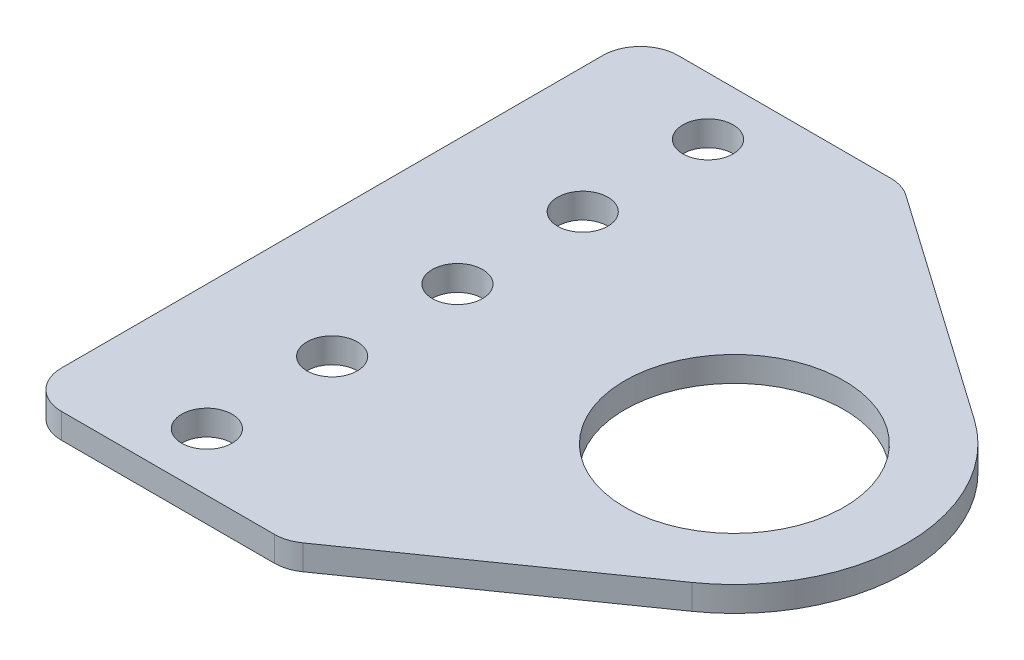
ISO-10303-21;
HEADER;
FILE_DESCRIPTION(('STEP AP214'),'2;1');
FILE_NAME('part.step','',(''),(''),'','','');
FILE_SCHEMA(('AUTOMOTIVE_DESIGN { 1 0 10303 214 1 1 1 1 }'));
ENDSEC;
DATA;
#1=APPLICATION_CONTEXT('core data for automotive mechanical design processes');
#2=APPLICATION_PROTOCOL_DEFINITION('international standard','automotive_design',2000,#1);
#3=PRODUCT_CONTEXT('',#1,'mechanical');
#4=PRODUCT('Part','Part','',(#3));
#5=PRODUCT_RELATED_PRODUCT_CATEGORY('part','',(#4));
#6=PRODUCT_DEFINITION_FORMATION('','',#4);
#7=PRODUCT_DEFINITION_CONTEXT('part definition',#1,'design');
#8=PRODUCT_DEFINITION('design','',#6,#7);
#9=PRODUCT_DEFINITION_SHAPE('','',#8);
#10=(LENGTH_UNIT() NAMED_UNIT(*) SI_UNIT(.MILLI.,.METRE.));
#11=(NAMED_UNIT(*) PLANE_ANGLE_UNIT() SI_UNIT($,.RADIAN.));
#12=(NAMED_UNIT(*) SI_UNIT($,.STERADIAN.) SOLID_ANGLE_UNIT());
#13=UNCERTAINTY_MEASURE_WITH_UNIT(LENGTH_MEASURE(1.E-05),#10,'distance_accuracy_value','');
#14=(GEOMETRIC_REPRESENTATION_CONTEXT(3) GLOBAL_UNCERTAINTY_ASSIGNED_CONTEXT((#13)) GLOBAL_UNIT_ASSIGNED_CONTEXT((#10,
#11,#12)) REPRESENTATION_CONTEXT('',''));
#15=CARTESIAN_POINT('',(0.,0.,0.));
#16=DIRECTION('',(0.,0.,1.));
#17=DIRECTION('',(1.,0.,0.));
#18=AXIS2_PLACEMENT_3D('',#15,#16,#17);
#19=CARTESIAN_POINT('',(-15.375,2.54,27.44));
#20=DIRECTION('',(0.,1.,0.));
#21=DIRECTION('',(0.,0.,1.));
#22=AXIS2_PLACEMENT_3D('',#19,#20,#21);
#23=PLANE('',#22);
#24=CARTESIAN_POINT('',(-28.075,2.54,12.7));
#25=DIRECTION('',(0.,1.,0.));
#26=DIRECTION('',(0.,0.,1.));
#27=AXIS2_PLACEMENT_3D('',#24,#25,#26);
#28=CIRCLE('',#27,2.5527);
#29=CARTESIAN_POINT('',(-28.075,2.54,15.2527));
#30=VERTEX_POINT('',#29);
#31=EDGE_CURVE('E286',#30,#30,#28,.T.);
#32=ORIENTED_EDGE('',*,*,#31,.F.);
#33=EDGE_LOOP('',(#32));
#34=FACE_BOUND('',#33,.T.);
#35=CARTESIAN_POINT('',(-28.075,2.54,-12.7));
#36=DIRECTION('',(0.,1.,0.));
#37=DIRECTION('',(0.,0.,1.));
#38=AXIS2_PLACEMENT_3D('',#35,#36,#37);
#39=CIRCLE('',#38,2.5527);
#40=CARTESIAN_POINT('',(-28.075,2.54,-10.1473));
#41=VERTEX_POINT('',#40);
#42=EDGE_CURVE('E270',#41,#41,#39,.T.);
#43=ORIENTED_EDGE('',*,*,#42,.F.);
#44=EDGE_LOOP('',(#43));
#45=FACE_BOUND('',#44,.T.);
#46=CARTESIAN_POINT('',(0.,2.54,0.));
#47=DIRECTION('',(0.,1.,0.));
#48=DIRECTION('',(0.,0.,1.));
#49=AXIS2_PLACEMENT_3D('',#46,#47,#48);
#50=CIRCLE('',#49,11.1125);
#51=CARTESIAN_POINT('',(0.,2.54,11.1125));
#52=VERTEX_POINT('',#51);
#53=EDGE_CURVE('E166',#52,#52,#50,.T.);
#54=ORIENTED_EDGE('',*,*,#53,.F.);
#55=EDGE_LOOP('',(#54));
#56=FACE_BOUND('',#55,.T.);
#57=CARTESIAN_POINT('',(-15.375,2.54,27.44));
#58=DIRECTION('',(0.,1.,0.));
#59=DIRECTION('',(0.,0.,1.));
#60=AXIS2_PLACEMENT_3D('',#57,#58,#59);
#61=CIRCLE('',#60,3.81);
#62=CARTESIAN_POINT('',(-15.375,2.54,31.25));
#63=VERTEX_POINT('',#62);
#64=CARTESIAN_POINT('',(-13.1889805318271,2.54,30.5604837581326));
#65=VERTEX_POINT('',#64);
#66=EDGE_CURVE('E190',#63,#65,#61,.T.);
#67=ORIENTED_EDGE('',*,*,#66,.T.);
#68=DIRECTION('',(0.819024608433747,0.,-0.573758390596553));
#69=VECTOR('',#68,1.);
#70=CARTESIAN_POINT('',(-13.1889805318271,2.54,30.5604837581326));
#71=LINE('',#70,#69);
#72=CARTESIAN_POINT('',(10.0192558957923,2.54,14.3022172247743));
#73=VERTEX_POINT('',#72);
#74=EDGE_CURVE('E113',#65,#73,#71,.T.);
#75=ORIENTED_EDGE('',*,*,#74,.T.);
#76=CARTESIAN_POINT('',(0.,2.54,0.));
#77=DIRECTION('',(0.,1.,0.));
#78=DIRECTION('',(0.,0.,1.));
#79=AXIS2_PLACEMENT_3D('',#76,#77,#78);
#80=CIRCLE('',#79,17.4625);
#81=CARTESIAN_POINT('',(10.0192558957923,2.54,-14.3022172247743));
#82=VERTEX_POINT('',#81);
#83=EDGE_CURVE('E220',#73,#82,#80,.T.);
#84=ORIENTED_EDGE('',*,*,#83,.T.);
#85=DIRECTION('',(-0.819024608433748,0.,-0.573758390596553));
#86=VECTOR('',#85,1.);
#87=CARTESIAN_POINT('',(10.0192558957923,2.54,-14.3022172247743));
#88=LINE('',#87,#86);
#89=CARTESIAN_POINT('',(-13.1889805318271,2.54,-30.5604837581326));
#90=VERTEX_POINT('',#89);
#91=EDGE_CURVE('E240',#82,#90,#88,.T.);
#92=ORIENTED_EDGE('',*,*,#91,.T.);
#93=CARTESIAN_POINT('',(-15.375,2.54,-27.44));
#94=DIRECTION('',(0.,1.,0.));
#95=DIRECTION('',(0.,0.,-1.));
#96=AXIS2_PLACEMENT_3D('',#93,#94,#95);
#97=CIRCLE('',#96,3.81);
#98=CARTESIAN_POINT('',(-15.375,2.54,-31.25));
#99=VERTEX_POINT('',#98);
#100=EDGE_CURVE('E236',#90,#99,#97,.T.);
#101=ORIENTED_EDGE('',*,*,#100,.T.);
#102=DIRECTION('',(-1.,0.,0.));
#103=VECTOR('',#102,1.);
#104=CARTESIAN_POINT('',(-36.965,2.54,-31.25));
#105=LINE('',#104,#103);
#106=CARTESIAN_POINT('',(-36.965,2.54,-31.25));
#107=VERTEX_POINT('',#106);
#108=EDGE_CURVE('E239',#99,#107,#105,.T.);
#109=ORIENTED_EDGE('',*,*,#108,.T.);
#110=CARTESIAN_POINT('',(-36.965,2.54,-27.44));
#111=DIRECTION('',(0.,1.,0.));
#112=DIRECTION('',(0.,0.,1.));
#113=AXIS2_PLACEMENT_3D('',#110,#111,#112);
#114=CIRCLE('',#113,3.81);
#115=CARTESIAN_POINT('',(-40.775,2.54,-27.44));
#116=VERTEX_POINT('',#115);
#117=EDGE_CURVE('E138',#107,#116,#114,.T.);
#118=ORIENTED_EDGE('',*,*,#117,.T.);
#119=DIRECTION('',(0.,0.,1.));
#120=VECTOR('',#119,1.);
#121=CARTESIAN_POINT('',(-40.775,2.54,27.44));
#122=LINE('',#121,#120);
#123=CARTESIAN_POINT('',(-40.775,2.54,27.44));
#124=VERTEX_POINT('',#123);
#125=EDGE_CURVE('E132',#116,#124,#122,.T.);
#126=ORIENTED_EDGE('',*,*,#125,.T.);
#127=CARTESIAN_POINT('',(-36.965,2.54,27.44));
#128=DIRECTION('',(0.,1.,0.));
#129=DIRECTION('',(0.,0.,1.));
#130=AXIS2_PLACEMENT_3D('',#127,#128,#129);
#131=CIRCLE('',#130,3.81);
#132=CARTESIAN_POINT('',(-36.965,2.54,31.25));
#133=VERTEX_POINT('',#132);
#134=EDGE_CURVE('E136',#124,#133,#131,.T.);
#135=ORIENTED_EDGE('',*,*,#134,.T.);
#136=DIRECTION('',(1.,0.,0.));
#137=VECTOR('',#136,1.);
#138=CARTESIAN_POINT('',(-15.375,2.54,31.25));
#139=LINE('',#138,#137);
#140=EDGE_CURVE('E64',#133,#63,#139,.T.);
#141=ORIENTED_EDGE('',*,*,#140,.T.);
#142=EDGE_LOOP('',(#67,#75,#84,#92,#101,#109,#118,#126,#135,#141));
#143=FACE_BOUND('',#142,.T.);
#144=CARTESIAN_POINT('',(-28.075,2.54,-25.4));
#145=DIRECTION('',(0.,1.,0.));
#146=DIRECTION('',(0.,0.,1.));
#147=AXIS2_PLACEMENT_3D('',#144,#145,#146);
#148=CIRCLE('',#147,2.5527);
#149=CARTESIAN_POINT('',(-28.075,2.54,-22.8473));
#150=VERTEX_POINT('',#149);
#151=EDGE_CURVE('E262',#150,#150,#148,.T.);
#152=ORIENTED_EDGE('',*,*,#151,.F.);
#153=EDGE_LOOP('',(#152));
#154=FACE_BOUND('',#153,.T.);
#155=CARTESIAN_POINT('',(-28.075,2.54,0.));
#156=DIRECTION('',(0.,1.,0.));
#157=DIRECTION('',(0.,0.,1.));
#158=AXIS2_PLACEMENT_3D('',#155,#156,#157);
#159=CIRCLE('',#158,2.55269999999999);
#160=CARTESIAN_POINT('',(-28.075,2.54,2.55269999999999));
#161=VERTEX_POINT('',#160);
#162=EDGE_CURVE('E278',#161,#161,#159,.T.);
#163=ORIENTED_EDGE('',*,*,#162,.F.);
#164=EDGE_LOOP('',(#163));
#165=FACE_BOUND('',#164,.T.);
#166=CARTESIAN_POINT('',(-28.075,2.54,25.4));
#167=DIRECTION('',(0.,1.,0.));
#168=DIRECTION('',(0.,0.,1.));
#169=AXIS2_PLACEMENT_3D('',#166,#167,#168);
#170=CIRCLE('',#169,2.5527);
#171=CARTESIAN_POINT('',(-28.075,2.54,27.9527));
#172=VERTEX_POINT('',#171);
#173=EDGE_CURVE('E294',#172,#172,#170,.T.);
#174=ORIENTED_EDGE('',*,*,#173,.F.);
#175=EDGE_LOOP('',(#174));
#176=FACE_BOUND('',#175,.T.);
#177=ADVANCED_FACE('F46',(#34,#45,#56,#143,#154,#165,#176),#23,.T.);
#178=CARTESIAN_POINT('',(-15.375,0.,27.44));
#179=DIRECTION('',(0.,1.,0.));
#180=DIRECTION('',(0.,0.,1.));
#181=AXIS2_PLACEMENT_3D('',#178,#179,#180);
#182=PLANE('',#181);
#183=CARTESIAN_POINT('',(-15.375,0.,27.44));
#184=DIRECTION('',(0.,1.,0.));
#185=DIRECTION('',(0.,0.,1.));
#186=AXIS2_PLACEMENT_3D('',#183,#184,#185);
#187=CIRCLE('',#186,3.81);
#188=CARTESIAN_POINT('',(-15.375,0.,31.25));
#189=VERTEX_POINT('',#188);
#190=CARTESIAN_POINT('',(-13.1889805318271,0.,30.5604837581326));
#191=VERTEX_POINT('',#190);
#192=EDGE_CURVE('E161',#189,#191,#187,.T.);
#193=ORIENTED_EDGE('',*,*,#192,.F.);
#194=DIRECTION('',(1.,0.,0.));
#195=VECTOR('',#194,1.);
#196=CARTESIAN_POINT('',(-15.375,0.,31.25));
#197=LINE('',#196,#195);
#198=CARTESIAN_POINT('',(-36.965,0.,31.25));
#199=VERTEX_POINT('',#198);
#200=EDGE_CURVE('E105',#199,#189,#197,.T.);
#201=ORIENTED_EDGE('',*,*,#200,.F.);
#202=CARTESIAN_POINT('',(-36.965,0.,27.44));
#203=DIRECTION('',(0.,1.,0.));
#204=DIRECTION('',(0.,0.,1.));
#205=AXIS2_PLACEMENT_3D('',#202,#203,#204);
#206=CIRCLE('',#205,3.81);
#207=CARTESIAN_POINT('',(-40.775,0.,27.44));
#208=VERTEX_POINT('',#207);
#209=EDGE_CURVE('E99',#208,#199,#206,.T.);
#210=ORIENTED_EDGE('',*,*,#209,.F.);
#211=DIRECTION('',(0.,0.,1.));
#212=VECTOR('',#211,1.);
#213=CARTESIAN_POINT('',(-40.775,0.,27.44));
#214=LINE('',#213,#212);
#215=CARTESIAN_POINT('',(-40.775,0.,-27.44));
#216=VERTEX_POINT('',#215);
#217=EDGE_CURVE('E147',#216,#208,#214,.T.);
#218=ORIENTED_EDGE('',*,*,#217,.F.);
#219=CARTESIAN_POINT('',(-36.965,0.,-27.44));
#220=DIRECTION('',(0.,1.,0.));
#221=DIRECTION('',(0.,0.,1.));
#222=AXIS2_PLACEMENT_3D('',#219,#220,#221);
#223=CIRCLE('',#222,3.81);
#224=CARTESIAN_POINT('',(-36.965,0.,-31.25));
#225=VERTEX_POINT('',#224);
#226=EDGE_CURVE('E181',#225,#216,#223,.T.);
#227=ORIENTED_EDGE('',*,*,#226,.F.);
#228=DIRECTION('',(-1.,0.,0.));
#229=VECTOR('',#228,1.);
#230=CARTESIAN_POINT('',(-36.965,0.,-31.25));
#231=LINE('',#230,#229);
#232=CARTESIAN_POINT('',(-15.375,0.,-31.25));
#233=VERTEX_POINT('',#232);
#234=EDGE_CURVE('E178',#233,#225,#231,.T.);
#235=ORIENTED_EDGE('',*,*,#234,.F.);
#236=CARTESIAN_POINT('',(-15.375,0.,-27.44));
#237=DIRECTION('',(0.,1.,0.));
#238=DIRECTION('',(0.,0.,-1.));
#239=AXIS2_PLACEMENT_3D('',#236,#237,#238);
#240=CIRCLE('',#239,3.81);
#241=CARTESIAN_POINT('',(-13.1889805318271,0.,-30.5604837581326));
#242=VERTEX_POINT('',#241);
#243=EDGE_CURVE('E175',#242,#233,#240,.T.);
#244=ORIENTED_EDGE('',*,*,#243,.F.);
#245=DIRECTION('',(-0.819024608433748,0.,-0.573758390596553));
#246=VECTOR('',#245,1.);
#247=CARTESIAN_POINT('',(10.0192558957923,0.,-14.3022172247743));
#248=LINE('',#247,#246);
#249=CARTESIAN_POINT('',(10.0192558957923,0.,-14.3022172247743));
#250=VERTEX_POINT('',#249);
#251=EDGE_CURVE('E172',#250,#242,#248,.T.);
#252=ORIENTED_EDGE('',*,*,#251,.F.);
#253=CARTESIAN_POINT('',(0.,0.,0.));
#254=DIRECTION('',(0.,1.,0.));
#255=DIRECTION('',(0.,0.,1.));
#256=AXIS2_PLACEMENT_3D('',#253,#254,#255);
#257=CIRCLE('',#256,17.4625);
#258=CARTESIAN_POINT('',(10.0192558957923,0.,14.3022172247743));
#259=VERTEX_POINT('',#258);
#260=EDGE_CURVE('E169',#259,#250,#257,.T.);
#261=ORIENTED_EDGE('',*,*,#260,.F.);
#262=DIRECTION('',(0.819024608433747,0.,-0.573758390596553));
#263=VECTOR('',#262,1.);
#264=CARTESIAN_POINT('',(-13.1889805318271,0.,30.5604837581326));
#265=LINE('',#264,#263);
#266=EDGE_CURVE('E165',#191,#259,#265,.T.);
#267=ORIENTED_EDGE('',*,*,#266,.F.);
#268=EDGE_LOOP('',(#193,#201,#210,#218,#227,#235,#244,#252,#261,#267));
#269=FACE_BOUND('',#268,.T.);
#270=CARTESIAN_POINT('',(0.,0.,0.));
#271=DIRECTION('',(0.,1.,0.));
#272=DIRECTION('',(0.,0.,1.));
#273=AXIS2_PLACEMENT_3D('',#270,#271,#272);
#274=CIRCLE('',#273,11.1125);
#275=CARTESIAN_POINT('',(0.,0.,11.1125));
#276=VERTEX_POINT('',#275);
#277=EDGE_CURVE('E258',#276,#276,#274,.T.);
#278=ORIENTED_EDGE('',*,*,#277,.T.);
#279=EDGE_LOOP('',(#278));
#280=FACE_BOUND('',#279,.T.);
#281=CARTESIAN_POINT('',(-28.075,0.,-25.4));
#282=DIRECTION('',(0.,1.,0.));
#283=DIRECTION('',(0.,0.,1.));
#284=AXIS2_PLACEMENT_3D('',#281,#282,#283);
#285=CIRCLE('',#284,2.5527);
#286=CARTESIAN_POINT('',(-28.075,0.,-22.8473));
#287=VERTEX_POINT('',#286);
#288=EDGE_CURVE('E266',#287,#287,#285,.T.);
#289=ORIENTED_EDGE('',*,*,#288,.T.);
#290=EDGE_LOOP('',(#289));
#291=FACE_BOUND('',#290,.T.);
#292=CARTESIAN_POINT('',(-28.075,0.,-12.7));
#293=DIRECTION('',(0.,1.,0.));
#294=DIRECTION('',(0.,0.,1.));
#295=AXIS2_PLACEMENT_3D('',#292,#293,#294);
#296=CIRCLE('',#295,2.5527);
#297=CARTESIAN_POINT('',(-28.075,0.,-10.1473));
#298=VERTEX_POINT('',#297);
#299=EDGE_CURVE('E274',#298,#298,#296,.T.);
#300=ORIENTED_EDGE('',*,*,#299,.T.);
#301=EDGE_LOOP('',(#300));
#302=FACE_BOUND('',#301,.T.);
#303=CARTESIAN_POINT('',(-28.075,0.,0.));
#304=DIRECTION('',(0.,1.,0.));
#305=DIRECTION('',(0.,0.,1.));
#306=AXIS2_PLACEMENT_3D('',#303,#304,#305);
#307=CIRCLE('',#306,2.55269999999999);
#308=CARTESIAN_POINT('',(-28.075,0.,2.55269999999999));
#309=VERTEX_POINT('',#308);
#310=EDGE_CURVE('E282',#309,#309,#307,.T.);
#311=ORIENTED_EDGE('',*,*,#310,.T.);
#312=EDGE_LOOP('',(#311));
#313=FACE_BOUND('',#312,.T.);
#314=CARTESIAN_POINT('',(-28.075,0.,12.7));
#315=DIRECTION('',(0.,1.,0.));
#316=DIRECTION('',(0.,0.,1.));
#317=AXIS2_PLACEMENT_3D('',#314,#315,#316);
#318=CIRCLE('',#317,2.5527);
#319=CARTESIAN_POINT('',(-28.075,0.,15.2527));
#320=VERTEX_POINT('',#319);
#321=EDGE_CURVE('E290',#320,#320,#318,.T.);
#322=ORIENTED_EDGE('',*,*,#321,.T.);
#323=EDGE_LOOP('',(#322));
#324=FACE_BOUND('',#323,.T.);
#325=CARTESIAN_POINT('',(-28.075,0.,25.4));
#326=DIRECTION('',(0.,1.,0.));
#327=DIRECTION('',(0.,0.,1.));
#328=AXIS2_PLACEMENT_3D('',#325,#326,#327);
#329=CIRCLE('',#328,2.5527);
#330=CARTESIAN_POINT('',(-28.075,0.,27.9527));
#331=VERTEX_POINT('',#330);
#332=EDGE_CURVE('E298',#331,#331,#329,.T.);
#333=ORIENTED_EDGE('',*,*,#332,.T.);
#334=EDGE_LOOP('',(#333));
#335=FACE_BOUND('',#334,.T.);
#336=ADVANCED_FACE('F224',(#269,#280,#291,#302,#313,#324,#335),#182,.F.);
#337=CARTESIAN_POINT('',(-15.375,2.54,27.44));
#338=DIRECTION('',(0.,-1.,0.));
#339=DIRECTION('',(0.,0.,-1.));
#340=AXIS2_PLACEMENT_3D('',#337,#338,#339);
#341=CYLINDRICAL_SURFACE('',#340,3.81);
#342=ORIENTED_EDGE('',*,*,#192,.T.);
#343=DIRECTION('',(0.,-1.,0.));
#344=VECTOR('',#343,1.);
#345=CARTESIAN_POINT('',(-13.1889805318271,2.54,30.5604837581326));
#346=LINE('',#345,#344);
#347=EDGE_CURVE('E13',#65,#191,#346,.T.);
#348=ORIENTED_EDGE('',*,*,#347,.F.);
#349=ORIENTED_EDGE('',*,*,#66,.F.);
#350=DIRECTION('',(0.,-1.,0.));
#351=VECTOR('',#350,1.);
#352=CARTESIAN_POINT('',(-15.375,2.54,31.25));
#353=LINE('',#352,#351);
#354=EDGE_CURVE('E157',#63,#189,#353,.T.);
#355=ORIENTED_EDGE('',*,*,#354,.T.);
#356=EDGE_LOOP('',(#342,#348,#349,#355));
#357=FACE_BOUND('',#356,.T.);
#358=ADVANCED_FACE('F48',(#357),#341,.T.);
#359=CARTESIAN_POINT('',(-13.1889805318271,2.54,30.5604837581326));
#360=DIRECTION('',(-0.573758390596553,0.,-0.819024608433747));
#361=DIRECTION('',(-0.819024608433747,0.,0.573758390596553));
#362=AXIS2_PLACEMENT_3D('',#359,#360,#361);
#363=PLANE('',#362);
#364=ORIENTED_EDGE('',*,*,#266,.T.);
#365=DIRECTION('',(0.,-1.,0.));
#366=VECTOR('',#365,1.);
#367=CARTESIAN_POINT('',(10.0192558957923,2.54,14.3022172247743));
#368=LINE('',#367,#366);
#369=EDGE_CURVE('E56',#73,#259,#368,.T.);
#370=ORIENTED_EDGE('',*,*,#369,.F.);
#371=ORIENTED_EDGE('',*,*,#74,.F.);
#372=ORIENTED_EDGE('',*,*,#347,.T.);
#373=EDGE_LOOP('',(#364,#370,#371,#372));
#374=FACE_BOUND('',#373,.T.);
#375=ADVANCED_FACE('F343',(#374),#363,.F.);
#376=CARTESIAN_POINT('',(0.,2.54,0.));
#377=DIRECTION('',(0.,-1.,0.));
#378=DIRECTION('',(0.,0.,-1.));
#379=AXIS2_PLACEMENT_3D('',#376,#377,#378);
#380=CYLINDRICAL_SURFACE('',#379,17.4625);
#381=ORIENTED_EDGE('',*,*,#260,.T.);
#382=DIRECTION('',(0.,-1.,0.));
#383=VECTOR('',#382,1.);
#384=CARTESIAN_POINT('',(10.0192558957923,2.54,-14.3022172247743));
#385=LINE('',#384,#383);
#386=EDGE_CURVE('E209',#82,#250,#385,.T.);
#387=ORIENTED_EDGE('',*,*,#386,.F.);
#388=ORIENTED_EDGE('',*,*,#83,.F.);
#389=ORIENTED_EDGE('',*,*,#369,.T.);
#390=EDGE_LOOP('',(#381,#387,#388,#389));
#391=FACE_BOUND('',#390,.T.);
#392=ADVANCED_FACE('F218',(#391),#380,.T.);
#393=CARTESIAN_POINT('',(10.0192558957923,2.54,-14.3022172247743));
#394=DIRECTION('',(-0.573758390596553,0.,0.819024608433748));
#395=DIRECTION('',(0.819024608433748,0.,0.573758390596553));
#396=AXIS2_PLACEMENT_3D('',#393,#394,#395);
#397=PLANE('',#396);
#398=ORIENTED_EDGE('',*,*,#251,.T.);
#399=DIRECTION('',(0.,-1.,0.));
#400=VECTOR('',#399,1.);
#401=CARTESIAN_POINT('',(-13.1889805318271,2.54,-30.5604837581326));
#402=LINE('',#401,#400);
#403=EDGE_CURVE('E205',#90,#242,#402,.T.);
#404=ORIENTED_EDGE('',*,*,#403,.F.);
#405=ORIENTED_EDGE('',*,*,#91,.F.);
#406=ORIENTED_EDGE('',*,*,#386,.T.);
#407=EDGE_LOOP('',(#398,#404,#405,#406));
#408=FACE_BOUND('',#407,.T.);
#409=ADVANCED_FACE('F230',(#408),#397,.F.);
#410=CARTESIAN_POINT('',(-15.375,2.54,-27.44));
#411=DIRECTION('',(0.,-1.,0.));
#412=DIRECTION('',(0.,0.,-1.));
#413=AXIS2_PLACEMENT_3D('',#410,#411,#412);
#414=CYLINDRICAL_SURFACE('',#413,3.81);
#415=ORIENTED_EDGE('',*,*,#243,.T.);
#416=DIRECTION('',(0.,-1.,0.));
#417=VECTOR('',#416,1.);
#418=CARTESIAN_POINT('',(-15.375,2.54,-31.25));
#419=LINE('',#418,#417);
#420=EDGE_CURVE('E201',#99,#233,#419,.T.);
#421=ORIENTED_EDGE('',*,*,#420,.F.);
#422=ORIENTED_EDGE('',*,*,#100,.F.);
#423=ORIENTED_EDGE('',*,*,#403,.T.);
#424=EDGE_LOOP('',(#415,#421,#422,#423));
#425=FACE_BOUND('',#424,.T.);
#426=ADVANCED_FACE('F234',(#425),#414,.T.);
#427=CARTESIAN_POINT('',(-36.965,2.54,-31.25));
#428=DIRECTION('',(0.,0.,1.));
#429=DIRECTION('',(1.,0.,0.));
#430=AXIS2_PLACEMENT_3D('',#427,#428,#429);
#431=PLANE('',#430);
#432=ORIENTED_EDGE('',*,*,#234,.T.);
#433=DIRECTION('',(0.,-1.,0.));
#434=VECTOR('',#433,1.);
#435=CARTESIAN_POINT('',(-36.965,2.54,-31.25));
#436=LINE('',#435,#434);
#437=EDGE_CURVE('E197',#107,#225,#436,.T.);
#438=ORIENTED_EDGE('',*,*,#437,.F.);
#439=ORIENTED_EDGE('',*,*,#108,.F.);
#440=ORIENTED_EDGE('',*,*,#420,.T.);
#441=EDGE_LOOP('',(#432,#438,#439,#440));
#442=FACE_BOUND('',#441,.T.);
#443=ADVANCED_FACE('F333',(#442),#431,.F.);
#444=CARTESIAN_POINT('',(-36.965,2.54,-27.44));
#445=DIRECTION('',(0.,-1.,0.));
#446=DIRECTION('',(0.,0.,-1.));
#447=AXIS2_PLACEMENT_3D('',#444,#445,#446);
#448=CYLINDRICAL_SURFACE('',#447,3.81);
#449=ORIENTED_EDGE('',*,*,#226,.T.);
#450=DIRECTION('',(0.,-1.,0.));
#451=VECTOR('',#450,1.);
#452=CARTESIAN_POINT('',(-40.775,2.54,-27.44));
#453=LINE('',#452,#451);
#454=EDGE_CURVE('E149',#116,#216,#453,.T.);
#455=ORIENTED_EDGE('',*,*,#454,.F.);
#456=ORIENTED_EDGE('',*,*,#117,.F.);
#457=ORIENTED_EDGE('',*,*,#437,.T.);
#458=EDGE_LOOP('',(#449,#455,#456,#457));
#459=FACE_BOUND('',#458,.T.);
#460=ADVANCED_FACE('F330',(#459),#448,.T.);
#461=CARTESIAN_POINT('',(-40.775,2.54,27.44));
#462=DIRECTION('',(1.,0.,0.));
#463=DIRECTION('',(0.,0.,-1.));
#464=AXIS2_PLACEMENT_3D('',#461,#462,#463);
#465=PLANE('',#464);
#466=ORIENTED_EDGE('',*,*,#217,.T.);
#467=DIRECTION('',(0.,-1.,0.));
#468=VECTOR('',#467,1.);
#469=CARTESIAN_POINT('',(-40.775,2.54,27.44));
#470=LINE('',#469,#468);
#471=EDGE_CURVE('E144',#124,#208,#470,.T.);
#472=ORIENTED_EDGE('',*,*,#471,.F.);
#473=ORIENTED_EDGE('',*,*,#125,.F.);
#474=ORIENTED_EDGE('',*,*,#454,.T.);
#475=EDGE_LOOP('',(#466,#472,#473,#474));
#476=FACE_BOUND('',#475,.T.);
#477=ADVANCED_FACE('F145',(#476),#465,.F.);
#478=CARTESIAN_POINT('',(-36.965,2.54,27.44));
#479=DIRECTION('',(0.,-1.,0.));
#480=DIRECTION('',(0.,0.,-1.));
#481=AXIS2_PLACEMENT_3D('',#478,#479,#480);
#482=CYLINDRICAL_SURFACE('',#481,3.81);
#483=ORIENTED_EDGE('',*,*,#209,.T.);
#484=DIRECTION('',(0.,-1.,0.));
#485=VECTOR('',#484,1.);
#486=CARTESIAN_POINT('',(-36.965,2.54,31.25));
#487=LINE('',#486,#485);
#488=EDGE_CURVE('E150',#133,#199,#487,.T.);
#489=ORIENTED_EDGE('',*,*,#488,.F.);
#490=ORIENTED_EDGE('',*,*,#134,.F.);
#491=ORIENTED_EDGE('',*,*,#471,.T.);
#492=EDGE_LOOP('',(#483,#489,#490,#491));
#493=FACE_BOUND('',#492,.T.);
#494=ADVANCED_FACE('F152',(#493),#482,.T.);
#495=CARTESIAN_POINT('',(-15.375,2.54,31.25));
#496=DIRECTION('',(0.,0.,-1.));
#497=DIRECTION('',(-1.,0.,0.));
#498=AXIS2_PLACEMENT_3D('',#495,#496,#497);
#499=PLANE('',#498);
#500=ORIENTED_EDGE('',*,*,#200,.T.);
#501=ORIENTED_EDGE('',*,*,#354,.F.);
#502=ORIENTED_EDGE('',*,*,#140,.F.);
#503=ORIENTED_EDGE('',*,*,#488,.T.);
#504=EDGE_LOOP('',(#500,#501,#502,#503));
#505=FACE_BOUND('',#504,.T.);
#506=ADVANCED_FACE('F323',(#505),#499,.F.);
#507=CARTESIAN_POINT('',(0.,2.54,0.));
#508=DIRECTION('',(0.,-1.,0.));
#509=DIRECTION('',(0.,0.,-1.));
#510=AXIS2_PLACEMENT_3D('',#507,#508,#509);
#511=CYLINDRICAL_SURFACE('',#510,11.1125);
#512=ORIENTED_EDGE('',*,*,#53,.T.);
#513=EDGE_LOOP('',(#512));
#514=FACE_BOUND('',#513,.T.);
#515=ORIENTED_EDGE('',*,*,#277,.F.);
#516=EDGE_LOOP('',(#515));
#517=FACE_BOUND('',#516,.T.);
#518=ADVANCED_FACE('F320',(#514,#517),#511,.F.);
#519=CARTESIAN_POINT('',(-28.075,2.54,-25.4));
#520=DIRECTION('',(0.,-1.,0.));
#521=DIRECTION('',(0.,0.,-1.));
#522=AXIS2_PLACEMENT_3D('',#519,#520,#521);
#523=CYLINDRICAL_SURFACE('',#522,2.5527);
#524=ORIENTED_EDGE('',*,*,#151,.T.);
#525=EDGE_LOOP('',(#524));
#526=FACE_BOUND('',#525,.T.);
#527=ORIENTED_EDGE('',*,*,#288,.F.);
#528=EDGE_LOOP('',(#527));
#529=FACE_BOUND('',#528,.T.);
#530=ADVANCED_FACE('F434',(#526,#529),#523,.F.);
#531=CARTESIAN_POINT('',(-28.075,2.54,-12.7));
#532=DIRECTION('',(0.,-1.,0.));
#533=DIRECTION('',(0.,0.,-1.));
#534=AXIS2_PLACEMENT_3D('',#531,#532,#533);
#535=CYLINDRICAL_SURFACE('',#534,2.5527);
#536=ORIENTED_EDGE('',*,*,#42,.T.);
#537=EDGE_LOOP('',(#536));
#538=FACE_BOUND('',#537,.T.);
#539=ORIENTED_EDGE('',*,*,#299,.F.);
#540=EDGE_LOOP('',(#539));
#541=FACE_BOUND('',#540,.T.);
#542=ADVANCED_FACE('F443',(#538,#541),#535,.F.);
#543=CARTESIAN_POINT('',(-28.075,2.54,0.));
#544=DIRECTION('',(0.,-1.,0.));
#545=DIRECTION('',(0.,0.,-1.));
#546=AXIS2_PLACEMENT_3D('',#543,#544,#545);
#547=CYLINDRICAL_SURFACE('',#546,2.55269999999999);
#548=ORIENTED_EDGE('',*,*,#162,.T.);
#549=EDGE_LOOP('',(#548));
#550=FACE_BOUND('',#549,.T.);
#551=ORIENTED_EDGE('',*,*,#310,.F.);
#552=EDGE_LOOP('',(#551));
#553=FACE_BOUND('',#552,.T.);
#554=ADVANCED_FACE('F452',(#550,#553),#547,.F.);
#555=CARTESIAN_POINT('',(-28.075,2.54,12.7));
#556=DIRECTION('',(0.,-1.,0.));
#557=DIRECTION('',(0.,0.,-1.));
#558=AXIS2_PLACEMENT_3D('',#555,#556,#557);
#559=CYLINDRICAL_SURFACE('',#558,2.5527);
#560=ORIENTED_EDGE('',*,*,#31,.T.);
#561=EDGE_LOOP('',(#560));
#562=FACE_BOUND('',#561,.T.);
#563=ORIENTED_EDGE('',*,*,#321,.F.);
#564=EDGE_LOOP('',(#563));
#565=FACE_BOUND('',#564,.T.);
#566=ADVANCED_FACE('F462',(#562,#565),#559,.F.);
#567=CARTESIAN_POINT('',(-28.075,2.54,25.4));
#568=DIRECTION('',(0.,-1.,0.));
#569=DIRECTION('',(0.,0.,-1.));
#570=AXIS2_PLACEMENT_3D('',#567,#568,#569);
#571=CYLINDRICAL_SURFACE('',#570,2.5527);
#572=ORIENTED_EDGE('',*,*,#173,.T.);
#573=EDGE_LOOP('',(#572));
#574=FACE_BOUND('',#573,.T.);
#575=ORIENTED_EDGE('',*,*,#332,.F.);
#576=EDGE_LOOP('',(#575));
#577=FACE_BOUND('',#576,.T.);
#578=ADVANCED_FACE('F307',(#574,#577),#571,.F.);
#579=CLOSED_SHELL('',(#177,#336,#358,#375,#392,#409,#426,#443,#460,#477,#494,#506,#518,#530,
#542,#554,#566,#578));
#580=MANIFOLD_SOLID_BREP('B2',#579);
#581=ADVANCED_BREP_SHAPE_REPRESENTATION('',(#18,#580),#14);
#582=SHAPE_DEFINITION_REPRESENTATION(#9,#581);
ENDSEC;
END-ISO-10303-21;
